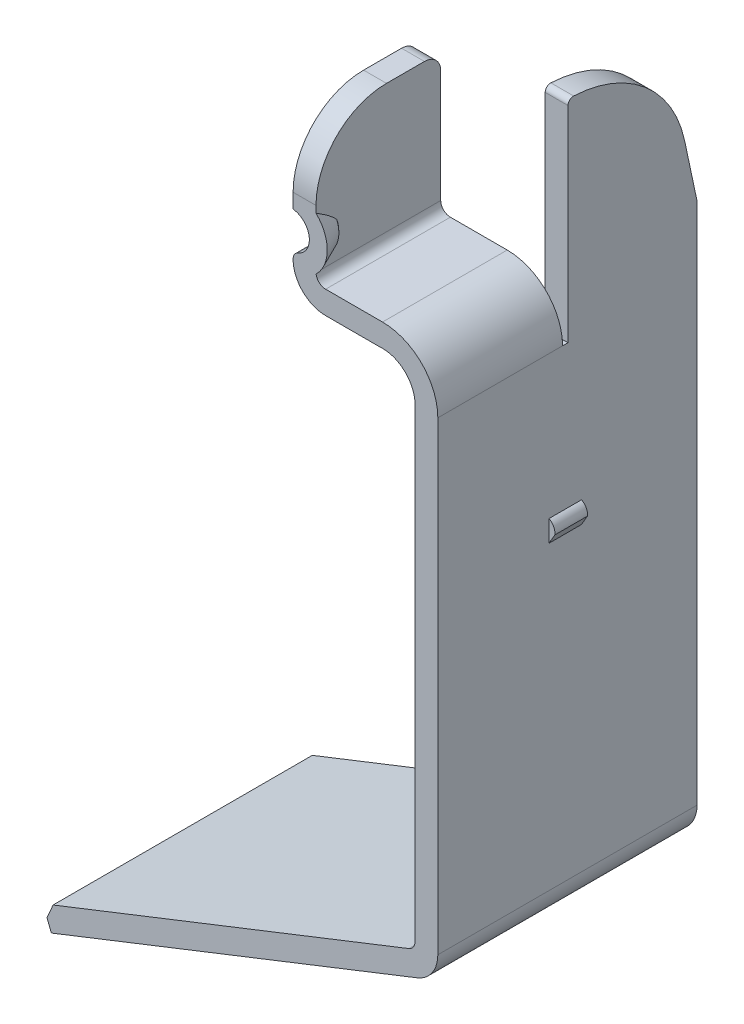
from build123d import *

# Parameters (mm, degrees)
SKETCH2_W               = 12.1412
SKETCH2_H               = 1.0668
SKETCH3_W               = 0.254
SKETCH3_H               = 9.8806
SKETCH3_W_2             = 5.842
CUT_EXTRUDE1_DEPTH      = 2.54
FILLET1_R               = 0.254
CHAMFER2_SIZE           = 0.508
BOSS_EXTRUDE1_DEPTH     = 5.842
CUT_EXTRUDE2_DEPTH      = 44.499710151
CUT_EXTRUDE2_DEPTH_BACK = 44.499710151
FILLET3_R               = 0.762
BOSS_EXTRUDE3_DEPTH     = 0.762
CUT_EXTRUDE3_DEPTH      = 1.524
CUT_EXTRUDE5_DEPTH      = 0.967492
SKETCH14_W              = 0.988166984
SKETCH14_H              = 0.522380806
CUT_EXTRUDE6_DEPTH      = 6.604


with BuildPart() as part:
    # Sweep1: sweep along a path in Sketch1
    with BuildLine(Plane.XY) as sweep1_path:
        Line((0, 0), (17.137124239, 6.75049276))
        ThreePointArc((17.137124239, 6.75049276), (17.838299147, 7.310734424), (18.10257637, 8.168449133))
        Line((18.10257637, 8.168449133), (18.10257637, 39.830923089))
    # Sketch2 → Sweep1 (sweep)
    with BuildSketch(Plane(origin=(0, 0, 0), x_dir=(0, 0, -1), z_dir=(0.9304175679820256, 0.36650122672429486, 0))):
        with Locations((6.0706, 0.5334)):
            Rectangle(SKETCH2_W, SKETCH2_H)
    sweep(path=sweep1_path.line)

    # Sketch3 → Cut-Extrude1 (cut)
    with BuildSketch(Plane(origin=(18.10257637, 0, 0), x_dir=(0, 0, -1), z_dir=(1, 0, 0))):
        with BuildLine():
            Line((12.1412, 39.830923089), (6.096, 39.830923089))
            ThreePointArc((6.096, 39.830923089), (9.612642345, 38.585614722), (11.561888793, 35.404733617))
            Line((11.561888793, 35.404733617), (12.1412, 32.67928867))
            Line((12.1412, 32.67928867), (12.1412, 39.830923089))
        make_face()
        with Locations((5.969, 34.890623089)):
            Rectangle(SKETCH3_W, SKETCH3_H)
        with Locations((2.921, 34.890623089)):
            Rectangle(SKETCH3_W_2, SKETCH3_H)
    extrude(amount=-CUT_EXTRUDE1_DEPTH, mode=Mode.SUBTRACT)

    # Fillet1
    fillet1_edges = [part.edges().sort_by_distance(p)[0] for p in [
        (17.56917637, 39.830923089, -6.096),
    ]]
    fillet(fillet1_edges, radius=FILLET1_R)

    # Chamfer2
    chamfer2_edges = [part.edges().sort_by_distance(p)[0] for p in [
        (-0.390983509, 0.992569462, -6.0706),
    ]]
    chamfer(chamfer2_edges, length=CHAMFER2_SIZE)

    # Sketch4 → Boss-Extrude1 (add)
    with BuildSketch(Plane.XY):
        with BuildLine():
            Line((15.37610401, 31.468272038), (12.847761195, 31.468272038))
            ThreePointArc((12.847761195, 31.468272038), (11.770130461, 31.914641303), (11.323761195, 32.992272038))
            Line((11.323761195, 32.992272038), (11.323761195, 39.443872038))
            Line((11.323761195, 39.443872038), (12.396612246, 39.443872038))
            Line((12.396612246, 39.443872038), (12.396612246, 32.992272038))
            ThreePointArc((12.396612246, 32.992272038), (12.528750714, 32.673261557), (12.847761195, 32.541123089))
            Line((12.847761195, 32.541123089), (15.51177637, 32.541123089))
            ThreePointArc((15.51177637, 32.541123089), (17.343748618, 31.782295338), (18.10257637, 29.950323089))
            Line((18.10257637, 29.950323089), (17.03577637, 29.950323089))
            ThreePointArc((17.03577637, 29.950323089), (16.54032178, 31.074898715), (15.37610401, 31.468272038))
        make_face()
    extrude(amount=-BOSS_EXTRUDE1_DEPTH)

    # Sketch5 → Cut-Extrude2 (cut, two sides: drawn at the far end of the back side and taken through both)
    with BuildSketch(Plane(origin=(12.396612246, 0, 0), x_dir=(0, 0, -1), z_dir=(1, 0, 0)).offset(-CUT_EXTRUDE2_DEPTH_BACK)):
        with BuildLine():
            ThreePointArc((0, 35.7124), (0.967133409, 38.047266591), (3.302, 39.0144))
            Line((3.302, 39.0144), (5.842, 39.0144))
            Line((5.842, 39.0144), (5.842, 39.443872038))
            Line((5.842, 39.443872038), (0, 39.443872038))
            Line((0, 39.443872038), (0, 35.7124))
        make_face()
    extrude(amount=CUT_EXTRUDE2_DEPTH + CUT_EXTRUDE2_DEPTH_BACK, mode=Mode.SUBTRACT)

    # Fillet3
    fillet3_edges = [part.edges().sort_by_distance(p)[0] for p in [
        (11.860186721, 39.0144, -5.842),
    ]]
    fillet(fillet3_edges, radius=FILLET3_R)

    # Sketch7 → Boss-Extrude3 (add, symmetric)
    with BuildSketch(Plane.XY.offset(-5.969)):
        with BuildLine():
            Line((18.10257637, 22.259209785), (18.376786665, 22.734155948))
            ThreePointArc((18.376786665, 22.734155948), (18.324456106, 23.041385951), (18.10257637, 23.260242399))
            Line((18.10257637, 23.260242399), (18.10257637, 22.259209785))
        make_face()
        with BuildLine():
            Line((17.03577637, 22.259209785), (17.309986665, 22.734155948))
            ThreePointArc((17.309986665, 22.734155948), (17.257656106, 23.041385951), (17.03577637, 23.260242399))
            Line((17.03577637, 23.260242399), (17.03577637, 22.259209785))
        make_face()
    extrude(amount=BOSS_EXTRUDE3_DEPTH, both=True)

    # Sketch7_3 → Cut-Extrude3 (cut)
    with BuildSketch(Plane.XY.offset(-5.969)):
        with BuildLine():
            Line((17.03577637, 22.259209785), (17.309986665, 22.734155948))
            ThreePointArc((17.309986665, 22.734155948), (17.257656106, 23.041385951), (17.03577637, 23.260242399))
            Line((17.03577637, 23.260242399), (17.03577637, 22.259209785))
        make_face()
    extrude(amount=-CUT_EXTRUDE3_DEPTH, mode=Mode.SUBTRACT)

    # Sweep5: sweep along a path in Sketch11
    with BuildLine(Plane.XY) as sweep5_path:
        ThreePointArc((12.212761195, 34.668672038), (12.328240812, 34.064374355), (12.106621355, 33.490444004))
    # Sketch8 → Sweep5 (sweep)
    with BuildSketch(Plane.XZ.offset(-34.668672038)):
        Polygon((12.847761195, 0), (12.396612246, -0.967492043), (11.323761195, -1.906466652), (12.212761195, 0), align=None)
    sweep(path=sweep5_path.line)

    # Sweep6: sweep along a path in Sketch12
    with BuildLine(Plane.XY) as sweep6_path:
        ThreePointArc((11.744975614, 35.149171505), (12.015732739, 34.944810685), (12.212761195, 34.668672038))
    # Sketch8_6 → Sweep6 (sweep)
    with BuildSketch(Plane.XZ.offset(-34.668672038)):
        Polygon((12.847761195, 0), (12.396612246, -0.967492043), (11.323761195, -1.906466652), (12.212761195, 0), align=None)
    sweep(path=sweep6_path.line)

    # Sketch13 → Cut-Extrude5 (cut)
    with BuildSketch(Plane.XY):
        with BuildLine():
            Line((11.323761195, 35.028691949), (10.619695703, 34.974794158))
            Line((10.619695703, 34.974794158), (10.804877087, 32.555774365))
            Line((10.804877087, 32.555774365), (11.283492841, 32.555774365))
            Line((11.283492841, 32.555774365), (11.323903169, 33.013073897))
            ThreePointArc((11.323903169, 33.013073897), (11.389358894, 33.223721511), (11.558882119, 33.364855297))
            ThreePointArc((11.558882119, 33.364855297), (12.07673455, 34.28656541), (11.323761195, 35.028691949))
        make_face()
    extrude(amount=-CUT_EXTRUDE5_DEPTH, mode=Mode.SUBTRACT)

    # Sketch14 → Cut-Extrude6 (cut)
    with BuildSketch(Plane.XY):
        with Locations((10.829677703, 34.767501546)):
            Rectangle(SKETCH14_W, SKETCH14_H)
    extrude(amount=-CUT_EXTRUDE6_DEPTH, mode=Mode.SUBTRACT)


solid = part.part
